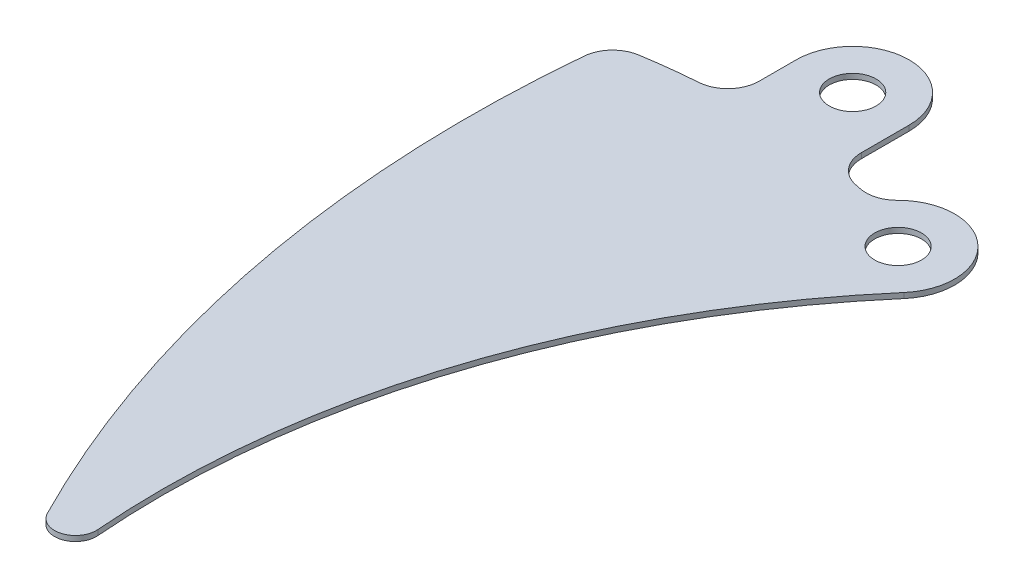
ISO-10303-21;
HEADER;
FILE_DESCRIPTION(('STEP AP214'),'2;1');
FILE_NAME('part.step','',(''),(''),'','','');
FILE_SCHEMA(('AUTOMOTIVE_DESIGN { 1 0 10303 214 1 1 1 1 }'));
ENDSEC;
DATA;
#1=APPLICATION_CONTEXT('core data for automotive mechanical design processes');
#2=APPLICATION_PROTOCOL_DEFINITION('international standard','automotive_design',2000,#1);
#3=PRODUCT_CONTEXT('',#1,'mechanical');
#4=PRODUCT('Part','Part','',(#3));
#5=PRODUCT_RELATED_PRODUCT_CATEGORY('part','',(#4));
#6=PRODUCT_DEFINITION_FORMATION('','',#4);
#7=PRODUCT_DEFINITION_CONTEXT('part definition',#1,'design');
#8=PRODUCT_DEFINITION('design','',#6,#7);
#9=PRODUCT_DEFINITION_SHAPE('','',#8);
#10=(LENGTH_UNIT() NAMED_UNIT(*) SI_UNIT(.MILLI.,.METRE.));
#11=(NAMED_UNIT(*) PLANE_ANGLE_UNIT() SI_UNIT($,.RADIAN.));
#12=(NAMED_UNIT(*) SI_UNIT($,.STERADIAN.) SOLID_ANGLE_UNIT());
#13=UNCERTAINTY_MEASURE_WITH_UNIT(LENGTH_MEASURE(1.E-05),#10,'distance_accuracy_value','');
#14=(GEOMETRIC_REPRESENTATION_CONTEXT(3) GLOBAL_UNCERTAINTY_ASSIGNED_CONTEXT((#13)) GLOBAL_UNIT_ASSIGNED_CONTEXT((#10,
#11,#12)) REPRESENTATION_CONTEXT('',''));
#15=CARTESIAN_POINT('',(0.,0.,0.));
#16=DIRECTION('',(0.,0.,1.));
#17=DIRECTION('',(1.,0.,0.));
#18=AXIS2_PLACEMENT_3D('',#15,#16,#17);
#19=CARTESIAN_POINT('',(2.71250000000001,1.8415,0.));
#20=DIRECTION('',(1.,0.,0.));
#21=DIRECTION('',(0.,0.,-1.));
#22=AXIS2_PLACEMENT_3D('',#19,#20,#21);
#23=PLANE('',#22);
#24=DIRECTION('',(0.,0.,1.));
#25=VECTOR('',#24,1.);
#26=CARTESIAN_POINT('',(2.71250000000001,1.8415,0.));
#27=LINE('',#26,#25);
#28=CARTESIAN_POINT('',(2.7125,1.8415,-33.25));
#29=VERTEX_POINT('',#28);
#30=CARTESIAN_POINT('',(2.7125,1.8415,-30.9547370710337));
#31=VERTEX_POINT('',#30);
#32=EDGE_CURVE('E250',#29,#31,#27,.T.);
#33=ORIENTED_EDGE('',*,*,#32,.T.);
#34=DIRECTION('',(0.,-1.,0.));
#35=VECTOR('',#34,1.);
#36=CARTESIAN_POINT('',(2.7125,1.8415,-30.9547370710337));
#37=LINE('',#36,#35);
#38=CARTESIAN_POINT('',(2.7125,1.5875,-30.9547370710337));
#39=VERTEX_POINT('',#38);
#40=EDGE_CURVE('E211',#31,#39,#37,.T.);
#41=ORIENTED_EDGE('',*,*,#40,.T.);
#42=DIRECTION('',(0.,0.,1.));
#43=VECTOR('',#42,1.);
#44=CARTESIAN_POINT('',(2.71250000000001,1.5875,0.));
#45=LINE('',#44,#43);
#46=CARTESIAN_POINT('',(2.7125,1.5875,-33.25));
#47=VERTEX_POINT('',#46);
#48=EDGE_CURVE('E171',#47,#39,#45,.T.);
#49=ORIENTED_EDGE('',*,*,#48,.F.);
#50=DIRECTION('',(0.,-1.,0.));
#51=VECTOR('',#50,1.);
#52=CARTESIAN_POINT('',(2.7125,1.8415,-33.25));
#53=LINE('',#52,#51);
#54=EDGE_CURVE('E194',#29,#47,#53,.T.);
#55=ORIENTED_EDGE('',*,*,#54,.F.);
#56=EDGE_LOOP('',(#33,#41,#49,#55));
#57=FACE_BOUND('',#56,.T.);
#58=ADVANCED_FACE('F35',(#57),#23,.T.);
#59=CARTESIAN_POINT('',(0.,1.8415,-33.25));
#60=DIRECTION('',(0.,-1.,0.));
#61=DIRECTION('',(0.,0.,-1.));
#62=AXIS2_PLACEMENT_3D('',#59,#60,#61);
#63=CYLINDRICAL_SURFACE('',#62,2.7125);
#64=CARTESIAN_POINT('',(0.,1.5875,-33.25));
#65=DIRECTION('',(0.,1.,0.));
#66=DIRECTION('',(0.,0.,1.));
#67=AXIS2_PLACEMENT_3D('',#64,#65,#66);
#68=CIRCLE('',#67,2.7125);
#69=CARTESIAN_POINT('',(-2.7125,1.5875,-33.25));
#70=VERTEX_POINT('',#69);
#71=EDGE_CURVE('E174',#47,#70,#68,.T.);
#72=ORIENTED_EDGE('',*,*,#71,.T.);
#73=DIRECTION('',(0.,-1.,0.));
#74=VECTOR('',#73,1.);
#75=CARTESIAN_POINT('',(-2.7125,1.8415,-33.25));
#76=LINE('',#75,#74);
#77=CARTESIAN_POINT('',(-2.7125,1.8415,-33.25));
#78=VERTEX_POINT('',#77);
#79=EDGE_CURVE('E142',#78,#70,#76,.T.);
#80=ORIENTED_EDGE('',*,*,#79,.F.);
#81=CARTESIAN_POINT('',(0.,1.8415,-33.25));
#82=DIRECTION('',(0.,1.,0.));
#83=DIRECTION('',(0.,0.,1.));
#84=AXIS2_PLACEMENT_3D('',#81,#82,#83);
#85=CIRCLE('',#84,2.7125);
#86=EDGE_CURVE('E254',#29,#78,#85,.T.);
#87=ORIENTED_EDGE('',*,*,#86,.F.);
#88=ORIENTED_EDGE('',*,*,#54,.T.);
#89=EDGE_LOOP('',(#72,#80,#87,#88));
#90=FACE_BOUND('',#89,.T.);
#91=ADVANCED_FACE('F291',(#90),#63,.T.);
#92=CARTESIAN_POINT('',(-2.71250000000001,1.8415,0.));
#93=DIRECTION('',(1.,0.,0.));
#94=DIRECTION('',(0.,0.,-1.));
#95=AXIS2_PLACEMENT_3D('',#92,#93,#94);
#96=PLANE('',#95);
#97=DIRECTION('',(0.,0.,1.));
#98=VECTOR('',#97,1.);
#99=CARTESIAN_POINT('',(-2.71250000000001,1.5875,0.));
#100=LINE('',#99,#98);
#101=CARTESIAN_POINT('',(-2.7125,1.5875,-31.4711729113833));
#102=VERTEX_POINT('',#101);
#103=EDGE_CURVE('E177',#70,#102,#100,.T.);
#104=ORIENTED_EDGE('',*,*,#103,.T.);
#105=DIRECTION('',(0.,1.,0.));
#106=VECTOR('',#105,1.);
#107=CARTESIAN_POINT('',(-2.7125,1.8415,-31.4711729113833));
#108=LINE('',#107,#106);
#109=CARTESIAN_POINT('',(-2.7125,1.8415,-31.4711729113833));
#110=VERTEX_POINT('',#109);
#111=EDGE_CURVE('E209',#102,#110,#108,.T.);
#112=ORIENTED_EDGE('',*,*,#111,.T.);
#113=DIRECTION('',(0.,0.,1.));
#114=VECTOR('',#113,1.);
#115=CARTESIAN_POINT('',(-2.71250000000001,1.8415,0.));
#116=LINE('',#115,#114);
#117=EDGE_CURVE('E162',#78,#110,#116,.T.);
#118=ORIENTED_EDGE('',*,*,#117,.F.);
#119=ORIENTED_EDGE('',*,*,#79,.T.);
#120=EDGE_LOOP('',(#104,#112,#118,#119));
#121=FACE_BOUND('',#120,.T.);
#122=ADVANCED_FACE('F296',(#121),#96,.F.);
#123=CARTESIAN_POINT('',(-1.90989379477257,1.8415,-0.055444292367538));
#124=DIRECTION('',(0.,-1.,0.));
#125=DIRECTION('',(0.,0.,-1.));
#126=AXIS2_PLACEMENT_3D('',#123,#124,#125);
#127=CYLINDRICAL_SURFACE('',#126,30.);
#128=CARTESIAN_POINT('',(-1.90989379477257,1.8415,-0.055444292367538));
#129=DIRECTION('',(0.,1.,0.));
#130=DIRECTION('',(0.,0.,1.));
#131=AXIS2_PLACEMENT_3D('',#128,#129,#130);
#132=CIRCLE('',#131,30.);
#133=CARTESIAN_POINT('',(-4.10285208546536,1.8415,-29.9751858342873));
#134=VERTEX_POINT('',#133);
#135=CARTESIAN_POINT('',(-6.70136862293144,1.8415,-29.6703352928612));
#136=VERTEX_POINT('',#135);
#137=EDGE_CURVE('E158',#134,#136,#132,.T.);
#138=ORIENTED_EDGE('',*,*,#137,.F.);
#139=DIRECTION('',(0.,-1.,0.));
#140=VECTOR('',#139,1.);
#141=CARTESIAN_POINT('',(-4.10285208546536,1.8415,-29.9751858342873));
#142=LINE('',#141,#140);
#143=CARTESIAN_POINT('',(-4.10285208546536,1.5875,-29.9751858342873));
#144=VERTEX_POINT('',#143);
#145=EDGE_CURVE('E206',#134,#144,#142,.T.);
#146=ORIENTED_EDGE('',*,*,#145,.T.);
#147=CARTESIAN_POINT('',(-1.90989379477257,1.5875,-0.055444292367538));
#148=DIRECTION('',(0.,1.,0.));
#149=DIRECTION('',(0.,0.,1.));
#150=AXIS2_PLACEMENT_3D('',#147,#148,#149);
#151=CIRCLE('',#150,30.);
#152=CARTESIAN_POINT('',(-6.70136862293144,1.5875,-29.6703352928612));
#153=VERTEX_POINT('',#152);
#154=EDGE_CURVE('E180',#144,#153,#151,.T.);
#155=ORIENTED_EDGE('',*,*,#154,.T.);
#156=DIRECTION('',(0.,-1.,0.));
#157=VECTOR('',#156,1.);
#158=CARTESIAN_POINT('',(-6.70136862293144,1.8415,-29.6703352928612));
#159=LINE('',#158,#157);
#160=EDGE_CURVE('E204',#153,#136,#159,.F.);
#161=ORIENTED_EDGE('',*,*,#160,.T.);
#162=EDGE_LOOP('',(#138,#146,#155,#161));
#163=FACE_BOUND('',#162,.T.);
#164=ADVANCED_FACE('F271',(#163),#127,.T.);
#165=CARTESIAN_POINT('',(7.49313671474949,1.8415,-27.9375827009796));
#166=DIRECTION('',(0.,-1.,0.));
#167=DIRECTION('',(0.,0.,-1.));
#168=AXIS2_PLACEMENT_3D('',#165,#166,#167);
#169=CYLINDRICAL_SURFACE('',#168,2.7125);
#170=CARTESIAN_POINT('',(7.49313671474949,1.5875,-27.9375827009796));
#171=DIRECTION('',(0.,1.,0.));
#172=DIRECTION('',(0.,0.,1.));
#173=AXIS2_PLACEMENT_3D('',#170,#171,#172);
#174=CIRCLE('',#173,2.7125);
#175=CARTESIAN_POINT('',(9.55265090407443,1.5875,-26.1723468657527));
#176=VERTEX_POINT('',#175);
#177=CARTESIAN_POINT('',(5.56296827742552,1.5875,-29.843391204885));
#178=VERTEX_POINT('',#177);
#179=EDGE_CURVE('E183',#176,#178,#174,.T.);
#180=ORIENTED_EDGE('',*,*,#179,.T.);
#181=DIRECTION('',(0.,-1.,0.));
#182=VECTOR('',#181,1.);
#183=CARTESIAN_POINT('',(5.56296827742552,1.8415,-29.843391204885));
#184=LINE('',#183,#182);
#185=CARTESIAN_POINT('',(5.56296827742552,1.8415,-29.843391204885));
#186=VERTEX_POINT('',#185);
#187=EDGE_CURVE('E156',#178,#186,#184,.F.);
#188=ORIENTED_EDGE('',*,*,#187,.T.);
#189=CARTESIAN_POINT('',(7.49313671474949,1.8415,-27.9375827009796));
#190=DIRECTION('',(0.,1.,0.));
#191=DIRECTION('',(0.,0.,1.));
#192=AXIS2_PLACEMENT_3D('',#189,#190,#191);
#193=CIRCLE('',#192,2.7125);
#194=CARTESIAN_POINT('',(9.55265090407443,1.8415,-26.1723468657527));
#195=VERTEX_POINT('',#194);
#196=EDGE_CURVE('E148',#195,#186,#193,.T.);
#197=ORIENTED_EDGE('',*,*,#196,.F.);
#198=DIRECTION('',(0.,-1.,0.));
#199=VECTOR('',#198,1.);
#200=CARTESIAN_POINT('',(9.55265090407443,1.8415,-26.1723468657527));
#201=LINE('',#200,#199);
#202=EDGE_CURVE('E131',#195,#176,#201,.T.);
#203=ORIENTED_EDGE('',*,*,#202,.T.);
#204=EDGE_LOOP('',(#180,#188,#197,#203));
#205=FACE_BOUND('',#204,.T.);
#206=ADVANCED_FACE('F154',(#205),#169,.T.);
#207=CARTESIAN_POINT('',(-1.90989379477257,1.8415,-0.055444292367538));
#208=DIRECTION('',(0.,-1.,0.));
#209=DIRECTION('',(0.,0.,-1.));
#210=AXIS2_PLACEMENT_3D('',#207,#208,#209);
#211=CYLINDRICAL_SURFACE('',#210,30.);
#212=CARTESIAN_POINT('',(-1.90989379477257,1.5875,-0.055444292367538));
#213=DIRECTION('',(0.,1.,0.));
#214=DIRECTION('',(0.,0.,1.));
#215=AXIS2_PLACEMENT_3D('',#212,#213,#214);
#216=CIRCLE('',#215,30.);
#217=CARTESIAN_POINT('',(4.19057079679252,1.5875,-29.428634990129));
#218=VERTEX_POINT('',#217);
#219=CARTESIAN_POINT('',(3.92095743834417,1.5875,-29.4833421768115));
#220=VERTEX_POINT('',#219);
#221=EDGE_CURVE('E185',#218,#220,#216,.T.);
#222=ORIENTED_EDGE('',*,*,#221,.T.);
#223=DIRECTION('',(0.,-1.,0.));
#224=VECTOR('',#223,1.);
#225=CARTESIAN_POINT('',(3.92095743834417,1.8415,-29.4833421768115));
#226=LINE('',#225,#224);
#227=CARTESIAN_POINT('',(3.92095743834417,1.8415,-29.4833421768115));
#228=VERTEX_POINT('',#227);
#229=EDGE_CURVE('E217',#220,#228,#226,.F.);
#230=ORIENTED_EDGE('',*,*,#229,.T.);
#231=CARTESIAN_POINT('',(-1.90989379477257,1.8415,-0.055444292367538));
#232=DIRECTION('',(0.,1.,0.));
#233=DIRECTION('',(0.,0.,1.));
#234=AXIS2_PLACEMENT_3D('',#231,#232,#233);
#235=CIRCLE('',#234,30.);
#236=CARTESIAN_POINT('',(4.19057079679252,1.8415,-29.428634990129));
#237=VERTEX_POINT('',#236);
#238=EDGE_CURVE('E157',#237,#228,#235,.T.);
#239=ORIENTED_EDGE('',*,*,#238,.F.);
#240=DIRECTION('',(0.,-1.,0.));
#241=VECTOR('',#240,1.);
#242=CARTESIAN_POINT('',(4.19057079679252,1.8415,-29.428634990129));
#243=LINE('',#242,#241);
#244=EDGE_CURVE('E214',#237,#218,#243,.T.);
#245=ORIENTED_EDGE('',*,*,#244,.T.);
#246=EDGE_LOOP('',(#222,#230,#239,#245));
#247=FACE_BOUND('',#246,.T.);
#248=ADVANCED_FACE('F242',(#247),#211,.T.);
#249=CARTESIAN_POINT('',(7.49313671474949,1.8415,-27.9375827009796));
#250=DIRECTION('',(0.,-1.,0.));
#251=DIRECTION('',(0.,0.,-1.));
#252=AXIS2_PLACEMENT_3D('',#249,#250,#251);
#253=CYLINDRICAL_SURFACE('',#252,1.125);
#254=CARTESIAN_POINT('',(7.49313671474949,1.8415,-27.9375827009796));
#255=DIRECTION('',(0.,1.,0.));
#256=DIRECTION('',(0.,0.,1.));
#257=AXIS2_PLACEMENT_3D('',#254,#255,#256);
#258=CIRCLE('',#257,1.125);
#259=CARTESIAN_POINT('',(7.49313671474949,1.8415,-26.8125827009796));
#260=VERTEX_POINT('',#259);
#261=EDGE_CURVE('E190',#260,#260,#258,.T.);
#262=ORIENTED_EDGE('',*,*,#261,.T.);
#263=EDGE_LOOP('',(#262));
#264=FACE_BOUND('',#263,.T.);
#265=CARTESIAN_POINT('',(7.49313671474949,1.5875,-27.9375827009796));
#266=DIRECTION('',(0.,1.,0.));
#267=DIRECTION('',(0.,0.,1.));
#268=AXIS2_PLACEMENT_3D('',#265,#266,#267);
#269=CIRCLE('',#268,1.125);
#270=CARTESIAN_POINT('',(7.49313671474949,1.5875,-26.8125827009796));
#271=VERTEX_POINT('',#270);
#272=EDGE_CURVE('E168',#271,#271,#269,.T.);
#273=ORIENTED_EDGE('',*,*,#272,.F.);
#274=EDGE_LOOP('',(#273));
#275=FACE_BOUND('',#274,.T.);
#276=ADVANCED_FACE('F301',(#264,#275),#253,.F.);
#277=CARTESIAN_POINT('',(0.,1.8415,-33.25));
#278=DIRECTION('',(0.,-1.,0.));
#279=DIRECTION('',(0.,0.,-1.));
#280=AXIS2_PLACEMENT_3D('',#277,#278,#279);
#281=CYLINDRICAL_SURFACE('',#280,1.125);
#282=CARTESIAN_POINT('',(0.,1.8415,-33.25));
#283=DIRECTION('',(0.,1.,0.));
#284=DIRECTION('',(0.,0.,1.));
#285=AXIS2_PLACEMENT_3D('',#282,#283,#284);
#286=CIRCLE('',#285,1.125);
#287=CARTESIAN_POINT('',(0.,1.8415,-32.125));
#288=VERTEX_POINT('',#287);
#289=EDGE_CURVE('E143',#288,#288,#286,.T.);
#290=ORIENTED_EDGE('',*,*,#289,.T.);
#291=EDGE_LOOP('',(#290));
#292=FACE_BOUND('',#291,.T.);
#293=CARTESIAN_POINT('',(0.,1.5875,-33.25));
#294=DIRECTION('',(0.,1.,0.));
#295=DIRECTION('',(0.,0.,1.));
#296=AXIS2_PLACEMENT_3D('',#293,#294,#295);
#297=CIRCLE('',#296,1.125);
#298=CARTESIAN_POINT('',(0.,1.5875,-32.125));
#299=VERTEX_POINT('',#298);
#300=EDGE_CURVE('E188',#299,#299,#297,.T.);
#301=ORIENTED_EDGE('',*,*,#300,.F.);
#302=EDGE_LOOP('',(#301));
#303=FACE_BOUND('',#302,.T.);
#304=ADVANCED_FACE('F304',(#292,#303),#281,.F.);
#305=CARTESIAN_POINT('',(0.,1.8415,0.));
#306=DIRECTION('',(0.,1.,0.));
#307=DIRECTION('',(0.,0.,1.));
#308=AXIS2_PLACEMENT_3D('',#305,#306,#307);
#309=PLANE('',#308);
#310=ORIENTED_EDGE('',*,*,#137,.T.);
#311=CARTESIAN_POINT('',(-6.46179488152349,1.8415,-28.1895907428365));
#312=DIRECTION('',(0.,1.,0.));
#313=DIRECTION('',(0.,0.,1.));
#314=AXIS2_PLACEMENT_3D('',#311,#312,#313);
#315=CIRCLE('',#314,1.5);
#316=CARTESIAN_POINT('',(-7.95540795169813,1.8415,-28.3278658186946));
#317=VERTEX_POINT('',#316);
#318=EDGE_CURVE('E50',#136,#317,#315,.T.);
#319=ORIENTED_EDGE('',*,*,#318,.T.);
#320=CARTESIAN_POINT('',(50.1774947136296,1.8415,-22.9460626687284));
#321=DIRECTION('',(0.,1.,0.));
#322=DIRECTION('',(0.,0.,1.));
#323=AXIS2_PLACEMENT_3D('',#320,#321,#322);
#324=CIRCLE('',#323,58.3814883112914);
#325=CARTESIAN_POINT('',(-1.83450095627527,1.8415,3.57092214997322));
#326=VERTEX_POINT('',#325);
#327=EDGE_CURVE('E152',#317,#326,#324,.T.);
#328=ORIENTED_EDGE('',*,*,#327,.T.);
#329=CARTESIAN_POINT('',(-0.943602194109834,1.8415,3.11672021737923));
#330=DIRECTION('',(0.,1.,0.));
#331=DIRECTION('',(0.,0.,1.));
#332=AXIS2_PLACEMENT_3D('',#329,#330,#331);
#333=CIRCLE('',#332,1.);
#334=CARTESIAN_POINT('',(0.0532194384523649,1.8415,3.03705446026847));
#335=VERTEX_POINT('',#334);
#336=EDGE_CURVE('E151',#326,#335,#333,.T.);
#337=ORIENTED_EDGE('',*,*,#336,.T.);
#338=CARTESIAN_POINT('',(39.9146808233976,1.8415,-0.148664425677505));
#339=DIRECTION('',(0.,1.,0.));
#340=DIRECTION('',(0.,0.,1.));
#341=AXIS2_PLACEMENT_3D('',#338,#339,#340);
#342=CIRCLE('',#341,39.9885597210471);
#343=EDGE_CURVE('E134',#195,#335,#342,.T.);
#344=ORIENTED_EDGE('',*,*,#343,.F.);
#345=ORIENTED_EDGE('',*,*,#196,.T.);
#346=CARTESIAN_POINT('',(4.49559402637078,1.8415,-30.8972945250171));
#347=DIRECTION('',(0.,1.,0.));
#348=DIRECTION('',(0.,0.,1.));
#349=AXIS2_PLACEMENT_3D('',#346,#347,#348);
#350=CIRCLE('',#349,1.5);
#351=EDGE_CURVE('E11',#186,#237,#350,.F.);
#352=ORIENTED_EDGE('',*,*,#351,.T.);
#353=ORIENTED_EDGE('',*,*,#238,.T.);
#354=CARTESIAN_POINT('',(4.2125,1.8415,-30.9547370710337));
#355=DIRECTION('',(0.,1.,0.));
#356=DIRECTION('',(0.,0.,1.));
#357=AXIS2_PLACEMENT_3D('',#354,#355,#356);
#358=CIRCLE('',#357,1.5);
#359=EDGE_CURVE('E230',#228,#31,#358,.F.);
#360=ORIENTED_EDGE('',*,*,#359,.T.);
#361=ORIENTED_EDGE('',*,*,#32,.F.);
#362=ORIENTED_EDGE('',*,*,#86,.T.);
#363=ORIENTED_EDGE('',*,*,#117,.T.);
#364=CARTESIAN_POINT('',(-4.2125,1.8415,-31.4711729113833));
#365=DIRECTION('',(0.,1.,0.));
#366=DIRECTION('',(0.,0.,1.));
#367=AXIS2_PLACEMENT_3D('',#364,#365,#366);
#368=CIRCLE('',#367,1.5);
#369=EDGE_CURVE('E226',#110,#134,#368,.F.);
#370=ORIENTED_EDGE('',*,*,#369,.T.);
#371=EDGE_LOOP('',(#310,#319,#328,#337,#344,#345,#352,#353,#360,#361,#362,#363,#370));
#372=FACE_BOUND('',#371,.T.);
#373=ORIENTED_EDGE('',*,*,#261,.F.);
#374=EDGE_LOOP('',(#373));
#375=FACE_BOUND('',#374,.T.);
#376=ORIENTED_EDGE('',*,*,#289,.F.);
#377=EDGE_LOOP('',(#376));
#378=FACE_BOUND('',#377,.T.);
#379=ADVANCED_FACE('F146',(#372,#375,#378),#309,.T.);
#380=CARTESIAN_POINT('',(0.,1.5875,0.));
#381=DIRECTION('',(0.,1.,0.));
#382=DIRECTION('',(0.,0.,1.));
#383=AXIS2_PLACEMENT_3D('',#380,#381,#382);
#384=PLANE('',#383);
#385=CARTESIAN_POINT('',(50.1774947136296,1.5875,-22.9460626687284));
#386=DIRECTION('',(0.,1.,0.));
#387=DIRECTION('',(0.,0.,1.));
#388=AXIS2_PLACEMENT_3D('',#385,#386,#387);
#389=CIRCLE('',#388,58.3814883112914);
#390=CARTESIAN_POINT('',(-1.83450095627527,1.5875,3.57092214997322));
#391=VERTEX_POINT('',#390);
#392=CARTESIAN_POINT('',(-7.95540795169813,1.5875,-28.3278658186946));
#393=VERTEX_POINT('',#392);
#394=EDGE_CURVE('E273',#391,#393,#389,.F.);
#395=ORIENTED_EDGE('',*,*,#394,.T.);
#396=CARTESIAN_POINT('',(-6.46179488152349,1.5875,-28.1895907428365));
#397=DIRECTION('',(0.,1.,0.));
#398=DIRECTION('',(0.,0.,1.));
#399=AXIS2_PLACEMENT_3D('',#396,#397,#398);
#400=CIRCLE('',#399,1.5);
#401=EDGE_CURVE('E58',#393,#153,#400,.F.);
#402=ORIENTED_EDGE('',*,*,#401,.T.);
#403=ORIENTED_EDGE('',*,*,#154,.F.);
#404=CARTESIAN_POINT('',(-4.2125,1.5875,-31.4711729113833));
#405=DIRECTION('',(0.,1.,0.));
#406=DIRECTION('',(0.,0.,1.));
#407=AXIS2_PLACEMENT_3D('',#404,#405,#406);
#408=CIRCLE('',#407,1.5);
#409=EDGE_CURVE('E224',#144,#102,#408,.T.);
#410=ORIENTED_EDGE('',*,*,#409,.T.);
#411=ORIENTED_EDGE('',*,*,#103,.F.);
#412=ORIENTED_EDGE('',*,*,#71,.F.);
#413=ORIENTED_EDGE('',*,*,#48,.T.);
#414=CARTESIAN_POINT('',(4.2125,1.5875,-30.9547370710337));
#415=DIRECTION('',(0.,1.,0.));
#416=DIRECTION('',(0.,0.,1.));
#417=AXIS2_PLACEMENT_3D('',#414,#415,#416);
#418=CIRCLE('',#417,1.5);
#419=EDGE_CURVE('E228',#39,#220,#418,.T.);
#420=ORIENTED_EDGE('',*,*,#419,.T.);
#421=ORIENTED_EDGE('',*,*,#221,.F.);
#422=CARTESIAN_POINT('',(4.49559402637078,1.5875,-30.8972945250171));
#423=DIRECTION('',(0.,1.,0.));
#424=DIRECTION('',(0.,0.,1.));
#425=AXIS2_PLACEMENT_3D('',#422,#423,#424);
#426=CIRCLE('',#425,1.5);
#427=EDGE_CURVE('E43',#218,#178,#426,.T.);
#428=ORIENTED_EDGE('',*,*,#427,.T.);
#429=ORIENTED_EDGE('',*,*,#179,.F.);
#430=CARTESIAN_POINT('',(39.9146808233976,1.5875,-0.148664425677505));
#431=DIRECTION('',(0.,1.,0.));
#432=DIRECTION('',(0.,0.,1.));
#433=AXIS2_PLACEMENT_3D('',#430,#431,#432);
#434=CIRCLE('',#433,39.9885597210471);
#435=CARTESIAN_POINT('',(0.0532194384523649,1.5875,3.03705446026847));
#436=VERTEX_POINT('',#435);
#437=EDGE_CURVE('E137',#436,#176,#434,.F.);
#438=ORIENTED_EDGE('',*,*,#437,.F.);
#439=CARTESIAN_POINT('',(-0.943602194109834,1.5875,3.11672021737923));
#440=DIRECTION('',(0.,1.,0.));
#441=DIRECTION('',(0.,0.,1.));
#442=AXIS2_PLACEMENT_3D('',#439,#440,#441);
#443=CIRCLE('',#442,1.);
#444=EDGE_CURVE('E202',#436,#391,#443,.F.);
#445=ORIENTED_EDGE('',*,*,#444,.T.);
#446=EDGE_LOOP('',(#395,#402,#403,#410,#411,#412,#413,#420,#421,#428,#429,#438,#445));
#447=FACE_BOUND('',#446,.T.);
#448=ORIENTED_EDGE('',*,*,#272,.T.);
#449=EDGE_LOOP('',(#448));
#450=FACE_BOUND('',#449,.T.);
#451=ORIENTED_EDGE('',*,*,#300,.T.);
#452=EDGE_LOOP('',(#451));
#453=FACE_BOUND('',#452,.T.);
#454=ADVANCED_FACE('F234',(#447,#450,#453),#384,.F.);
#455=CARTESIAN_POINT('',(50.1774947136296,-40.0719849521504,-22.9460626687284));
#456=DIRECTION('',(0.,1.,0.));
#457=DIRECTION('',(0.,0.,1.));
#458=AXIS2_PLACEMENT_3D('',#455,#456,#457);
#459=CYLINDRICAL_SURFACE('',#458,58.3814883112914);
#460=ORIENTED_EDGE('',*,*,#327,.F.);
#461=DIRECTION('',(0.,1.,0.));
#462=VECTOR('',#461,1.);
#463=CARTESIAN_POINT('',(-7.95540795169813,-40.0719849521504,-28.3278658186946));
#464=LINE('',#463,#462);
#465=EDGE_CURVE('E220',#317,#393,#464,.F.);
#466=ORIENTED_EDGE('',*,*,#465,.T.);
#467=ORIENTED_EDGE('',*,*,#394,.F.);
#468=DIRECTION('',(0.,1.,0.));
#469=VECTOR('',#468,1.);
#470=CARTESIAN_POINT('',(-1.83450095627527,-40.0719849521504,3.57092214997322));
#471=LINE('',#470,#469);
#472=EDGE_CURVE('E196',#391,#326,#471,.T.);
#473=ORIENTED_EDGE('',*,*,#472,.T.);
#474=EDGE_LOOP('',(#460,#466,#467,#473));
#475=FACE_BOUND('',#474,.T.);
#476=ADVANCED_FACE('F281',(#475),#459,.T.);
#477=CARTESIAN_POINT('',(39.9146808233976,-40.0719849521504,-0.148664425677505));
#478=DIRECTION('',(0.,1.,0.));
#479=DIRECTION('',(0.,0.,1.));
#480=AXIS2_PLACEMENT_3D('',#477,#478,#479);
#481=CYLINDRICAL_SURFACE('',#480,39.9885597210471);
#482=ORIENTED_EDGE('',*,*,#343,.T.);
#483=DIRECTION('',(0.,1.,0.));
#484=VECTOR('',#483,1.);
#485=CARTESIAN_POINT('',(0.0532194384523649,-40.0719849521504,3.03705446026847));
#486=LINE('',#485,#484);
#487=EDGE_CURVE('E200',#335,#436,#486,.F.);
#488=ORIENTED_EDGE('',*,*,#487,.T.);
#489=ORIENTED_EDGE('',*,*,#437,.T.);
#490=ORIENTED_EDGE('',*,*,#202,.F.);
#491=EDGE_LOOP('',(#482,#488,#489,#490));
#492=FACE_BOUND('',#491,.T.);
#493=ADVANCED_FACE('F133',(#492),#481,.F.);
#494=CARTESIAN_POINT('',(-0.943602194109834,-40.0719849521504,3.11672021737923));
#495=DIRECTION('',(0.,-1.,0.));
#496=DIRECTION('',(0.,0.,-1.));
#497=AXIS2_PLACEMENT_3D('',#494,#495,#496);
#498=CYLINDRICAL_SURFACE('',#497,1.);
#499=ORIENTED_EDGE('',*,*,#444,.F.);
#500=ORIENTED_EDGE('',*,*,#487,.F.);
#501=ORIENTED_EDGE('',*,*,#336,.F.);
#502=ORIENTED_EDGE('',*,*,#472,.F.);
#503=EDGE_LOOP('',(#499,#500,#501,#502));
#504=FACE_BOUND('',#503,.T.);
#505=ADVANCED_FACE('F280',(#504),#498,.T.);
#506=CARTESIAN_POINT('',(-4.2125,1.8415,-31.4711729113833));
#507=DIRECTION('',(0.,-1.,0.));
#508=DIRECTION('',(0.,0.,-1.));
#509=AXIS2_PLACEMENT_3D('',#506,#507,#508);
#510=CYLINDRICAL_SURFACE('',#509,1.5);
#511=ORIENTED_EDGE('',*,*,#369,.F.);
#512=ORIENTED_EDGE('',*,*,#111,.F.);
#513=ORIENTED_EDGE('',*,*,#409,.F.);
#514=ORIENTED_EDGE('',*,*,#145,.F.);
#515=EDGE_LOOP('',(#511,#512,#513,#514));
#516=FACE_BOUND('',#515,.T.);
#517=ADVANCED_FACE('F268',(#516),#510,.F.);
#518=CARTESIAN_POINT('',(4.2125,1.8415,-30.9547370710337));
#519=DIRECTION('',(0.,-1.,0.));
#520=DIRECTION('',(0.,0.,-1.));
#521=AXIS2_PLACEMENT_3D('',#518,#519,#520);
#522=CYLINDRICAL_SURFACE('',#521,1.5);
#523=ORIENTED_EDGE('',*,*,#359,.F.);
#524=ORIENTED_EDGE('',*,*,#229,.F.);
#525=ORIENTED_EDGE('',*,*,#419,.F.);
#526=ORIENTED_EDGE('',*,*,#40,.F.);
#527=EDGE_LOOP('',(#523,#524,#525,#526));
#528=FACE_BOUND('',#527,.T.);
#529=ADVANCED_FACE('F245',(#528),#522,.F.);
#530=CARTESIAN_POINT('',(4.49559402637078,1.8415,-30.8972945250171));
#531=DIRECTION('',(0.,1.,0.));
#532=DIRECTION('',(0.,0.,1.));
#533=AXIS2_PLACEMENT_3D('',#530,#531,#532);
#534=CYLINDRICAL_SURFACE('',#533,1.5);
#535=ORIENTED_EDGE('',*,*,#351,.F.);
#536=ORIENTED_EDGE('',*,*,#187,.F.);
#537=ORIENTED_EDGE('',*,*,#427,.F.);
#538=ORIENTED_EDGE('',*,*,#244,.F.);
#539=EDGE_LOOP('',(#535,#536,#537,#538));
#540=FACE_BOUND('',#539,.T.);
#541=ADVANCED_FACE('F238',(#540),#534,.F.);
#542=CARTESIAN_POINT('',(-6.46179488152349,1.8415,-28.1895907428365));
#543=DIRECTION('',(0.,-1.,0.));
#544=DIRECTION('',(0.,0.,-1.));
#545=AXIS2_PLACEMENT_3D('',#542,#543,#544);
#546=CYLINDRICAL_SURFACE('',#545,1.5);
#547=ORIENTED_EDGE('',*,*,#318,.F.);
#548=ORIENTED_EDGE('',*,*,#160,.F.);
#549=ORIENTED_EDGE('',*,*,#401,.F.);
#550=ORIENTED_EDGE('',*,*,#465,.F.);
#551=EDGE_LOOP('',(#547,#548,#549,#550));
#552=FACE_BOUND('',#551,.T.);
#553=ADVANCED_FACE('F37',(#552),#546,.T.);
#554=CLOSED_SHELL('',(#58,#91,#122,#164,#206,#248,#276,#304,#379,#454,#476,#493,#505,#517,#529,
#541,#553));
#555=MANIFOLD_SOLID_BREP('B2',#554);
#556=ADVANCED_BREP_SHAPE_REPRESENTATION('',(#18,#555),#14);
#557=SHAPE_DEFINITION_REPRESENTATION(#9,#556);
ENDSEC;
END-ISO-10303-21;
